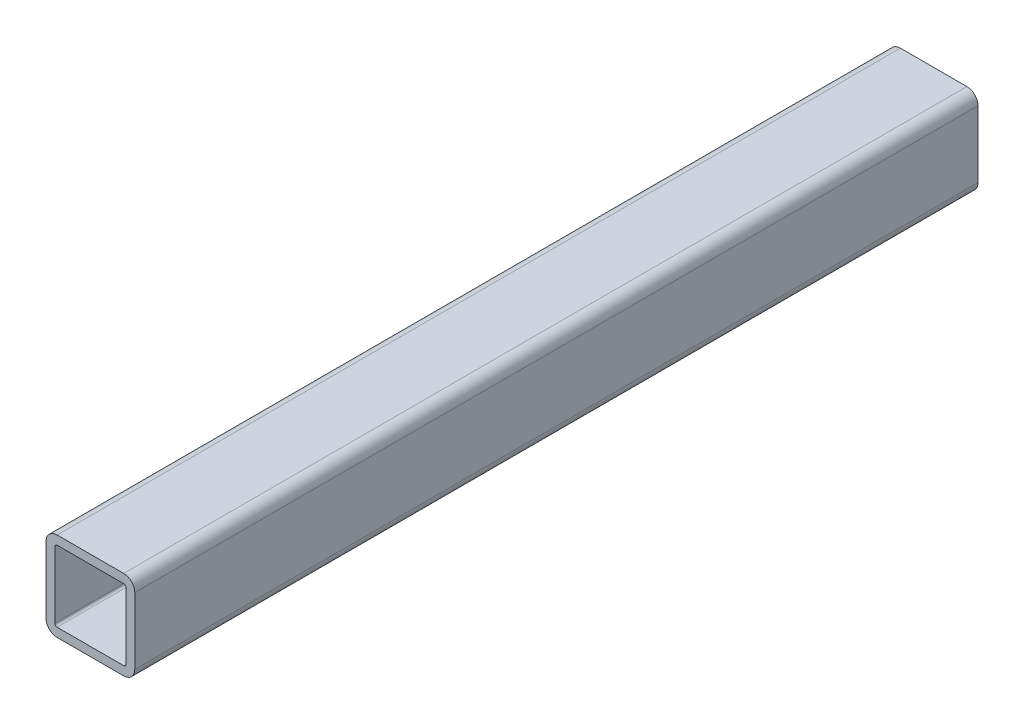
ISO-10303-21;
HEADER;
FILE_DESCRIPTION(('STEP AP214'),'2;1');
FILE_NAME('part.step','',(''),(''),'','','');
FILE_SCHEMA(('AUTOMOTIVE_DESIGN { 1 0 10303 214 1 1 1 1 }'));
ENDSEC;
DATA;
#1=APPLICATION_CONTEXT('core data for automotive mechanical design processes');
#2=APPLICATION_PROTOCOL_DEFINITION('international standard','automotive_design',2000,#1);
#3=PRODUCT_CONTEXT('',#1,'mechanical');
#4=PRODUCT('Part','Part','',(#3));
#5=PRODUCT_RELATED_PRODUCT_CATEGORY('part','',(#4));
#6=PRODUCT_DEFINITION_FORMATION('','',#4);
#7=PRODUCT_DEFINITION_CONTEXT('part definition',#1,'design');
#8=PRODUCT_DEFINITION('design','',#6,#7);
#9=PRODUCT_DEFINITION_SHAPE('','',#8);
#10=(LENGTH_UNIT() NAMED_UNIT(*) SI_UNIT(.MILLI.,.METRE.));
#11=(NAMED_UNIT(*) PLANE_ANGLE_UNIT() SI_UNIT($,.RADIAN.));
#12=(NAMED_UNIT(*) SI_UNIT($,.STERADIAN.) SOLID_ANGLE_UNIT());
#13=UNCERTAINTY_MEASURE_WITH_UNIT(LENGTH_MEASURE(1.E-05),#10,'distance_accuracy_value','');
#14=(GEOMETRIC_REPRESENTATION_CONTEXT(3) GLOBAL_UNCERTAINTY_ASSIGNED_CONTEXT((#13)) GLOBAL_UNIT_ASSIGNED_CONTEXT((#10,
#11,#12)) REPRESENTATION_CONTEXT('',''));
#15=CARTESIAN_POINT('',(0.,0.,0.));
#16=DIRECTION('',(0.,0.,1.));
#17=DIRECTION('',(1.,0.,0.));
#18=AXIS2_PLACEMENT_3D('',#15,#16,#17);
#19=CARTESIAN_POINT('',(-7.5,-7.5,95.));
#20=DIRECTION('',(0.,0.,1.));
#21=DIRECTION('',(1.,0.,0.));
#22=AXIS2_PLACEMENT_3D('',#19,#20,#21);
#23=PLANE('',#22);
#24=CARTESIAN_POINT('',(-7.5,-7.5,95.));
#25=DIRECTION('',(0.,0.,1.));
#26=DIRECTION('',(1.,0.,0.));
#27=AXIS2_PLACEMENT_3D('',#24,#25,#26);
#28=CIRCLE('',#27,2.5);
#29=CARTESIAN_POINT('',(-10.,-7.5,95.));
#30=VERTEX_POINT('',#29);
#31=CARTESIAN_POINT('',(-7.5,-10.,95.));
#32=VERTEX_POINT('',#31);
#33=EDGE_CURVE('E210',#30,#32,#28,.T.);
#34=ORIENTED_EDGE('',*,*,#33,.T.);
#35=DIRECTION('',(1.,0.,0.));
#36=VECTOR('',#35,1.);
#37=CARTESIAN_POINT('',(-7.5,-10.,95.));
#38=LINE('',#37,#36);
#39=CARTESIAN_POINT('',(7.5,-10.,95.));
#40=VERTEX_POINT('',#39);
#41=EDGE_CURVE('E213',#32,#40,#38,.T.);
#42=ORIENTED_EDGE('',*,*,#41,.T.);
#43=CARTESIAN_POINT('',(7.5,-7.5,95.));
#44=DIRECTION('',(0.,0.,1.));
#45=DIRECTION('',(1.,0.,0.));
#46=AXIS2_PLACEMENT_3D('',#43,#44,#45);
#47=CIRCLE('',#46,2.5);
#48=CARTESIAN_POINT('',(10.,-7.5,95.));
#49=VERTEX_POINT('',#48);
#50=EDGE_CURVE('E216',#40,#49,#47,.T.);
#51=ORIENTED_EDGE('',*,*,#50,.T.);
#52=DIRECTION('',(0.,1.,0.));
#53=VECTOR('',#52,1.);
#54=CARTESIAN_POINT('',(10.,7.5,95.));
#55=LINE('',#54,#53);
#56=CARTESIAN_POINT('',(10.,7.5,95.));
#57=VERTEX_POINT('',#56);
#58=EDGE_CURVE('E218',#49,#57,#55,.T.);
#59=ORIENTED_EDGE('',*,*,#58,.T.);
#60=CARTESIAN_POINT('',(7.5,7.5,95.));
#61=DIRECTION('',(0.,0.,1.));
#62=DIRECTION('',(-1.,0.,0.));
#63=AXIS2_PLACEMENT_3D('',#60,#61,#62);
#64=CIRCLE('',#63,2.5);
#65=CARTESIAN_POINT('',(7.5,10.,95.));
#66=VERTEX_POINT('',#65);
#67=EDGE_CURVE('E220',#57,#66,#64,.T.);
#68=ORIENTED_EDGE('',*,*,#67,.T.);
#69=DIRECTION('',(-1.,0.,0.));
#70=VECTOR('',#69,1.);
#71=CARTESIAN_POINT('',(-7.5,10.,95.));
#72=LINE('',#71,#70);
#73=CARTESIAN_POINT('',(-7.5,10.,95.));
#74=VERTEX_POINT('',#73);
#75=EDGE_CURVE('E222',#66,#74,#72,.T.);
#76=ORIENTED_EDGE('',*,*,#75,.T.);
#77=CARTESIAN_POINT('',(-7.5,7.5,95.));
#78=DIRECTION('',(0.,0.,1.));
#79=DIRECTION('',(1.,0.,0.));
#80=AXIS2_PLACEMENT_3D('',#77,#78,#79);
#81=CIRCLE('',#80,2.5);
#82=CARTESIAN_POINT('',(-10.,7.5,95.));
#83=VERTEX_POINT('',#82);
#84=EDGE_CURVE('E224',#74,#83,#81,.T.);
#85=ORIENTED_EDGE('',*,*,#84,.T.);
#86=DIRECTION('',(0.,-1.,0.));
#87=VECTOR('',#86,1.);
#88=CARTESIAN_POINT('',(-10.,7.5,95.));
#89=LINE('',#88,#87);
#90=EDGE_CURVE('E226',#83,#30,#89,.T.);
#91=ORIENTED_EDGE('',*,*,#90,.T.);
#92=EDGE_LOOP('',(#34,#42,#51,#59,#68,#76,#85,#91));
#93=FACE_BOUND('',#92,.T.);
#94=DIRECTION('',(0.,-1.,0.));
#95=VECTOR('',#94,1.);
#96=CARTESIAN_POINT('',(-8.,7.5,95.));
#97=LINE('',#96,#95);
#98=CARTESIAN_POINT('',(-8.,7.5,95.));
#99=VERTEX_POINT('',#98);
#100=CARTESIAN_POINT('',(-8.,-7.5,95.));
#101=VERTEX_POINT('',#100);
#102=EDGE_CURVE('E153',#99,#101,#97,.T.);
#103=ORIENTED_EDGE('',*,*,#102,.F.);
#104=CARTESIAN_POINT('',(-7.5,7.5,95.));
#105=DIRECTION('',(0.,0.,1.));
#106=DIRECTION('',(1.,0.,0.));
#107=AXIS2_PLACEMENT_3D('',#104,#105,#106);
#108=CIRCLE('',#107,0.5);
#109=CARTESIAN_POINT('',(-7.5,8.,95.));
#110=VERTEX_POINT('',#109);
#111=EDGE_CURVE('E145',#110,#99,#108,.T.);
#112=ORIENTED_EDGE('',*,*,#111,.F.);
#113=DIRECTION('',(-1.,0.,0.));
#114=VECTOR('',#113,1.);
#115=CARTESIAN_POINT('',(-7.5,8.,95.));
#116=LINE('',#115,#114);
#117=CARTESIAN_POINT('',(7.5,8.,95.));
#118=VERTEX_POINT('',#117);
#119=EDGE_CURVE('E178',#118,#110,#116,.T.);
#120=ORIENTED_EDGE('',*,*,#119,.F.);
#121=CARTESIAN_POINT('',(7.5,7.5,95.));
#122=DIRECTION('',(0.,0.,1.));
#123=DIRECTION('',(-1.,0.,0.));
#124=AXIS2_PLACEMENT_3D('',#121,#122,#123);
#125=CIRCLE('',#124,0.5);
#126=CARTESIAN_POINT('',(8.,7.5,95.));
#127=VERTEX_POINT('',#126);
#128=EDGE_CURVE('E176',#127,#118,#125,.T.);
#129=ORIENTED_EDGE('',*,*,#128,.F.);
#130=DIRECTION('',(0.,1.,0.));
#131=VECTOR('',#130,1.);
#132=CARTESIAN_POINT('',(8.,7.5,95.));
#133=LINE('',#132,#131);
#134=CARTESIAN_POINT('',(8.,-7.5,95.));
#135=VERTEX_POINT('',#134);
#136=EDGE_CURVE('E174',#135,#127,#133,.T.);
#137=ORIENTED_EDGE('',*,*,#136,.F.);
#138=CARTESIAN_POINT('',(7.5,-7.5,95.));
#139=DIRECTION('',(0.,0.,1.));
#140=DIRECTION('',(1.,0.,0.));
#141=AXIS2_PLACEMENT_3D('',#138,#139,#140);
#142=CIRCLE('',#141,0.500000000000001);
#143=CARTESIAN_POINT('',(7.5,-8.,95.));
#144=VERTEX_POINT('',#143);
#145=EDGE_CURVE('E172',#144,#135,#142,.T.);
#146=ORIENTED_EDGE('',*,*,#145,.F.);
#147=DIRECTION('',(1.,0.,0.));
#148=VECTOR('',#147,1.);
#149=CARTESIAN_POINT('',(-7.5,-8.,95.));
#150=LINE('',#149,#148);
#151=CARTESIAN_POINT('',(-7.5,-8.,95.));
#152=VERTEX_POINT('',#151);
#153=EDGE_CURVE('E168',#152,#144,#150,.T.);
#154=ORIENTED_EDGE('',*,*,#153,.F.);
#155=CARTESIAN_POINT('',(-7.5,-7.5,95.));
#156=DIRECTION('',(0.,0.,1.));
#157=DIRECTION('',(1.,0.,0.));
#158=AXIS2_PLACEMENT_3D('',#155,#156,#157);
#159=CIRCLE('',#158,0.5);
#160=EDGE_CURVE('E166',#101,#152,#159,.T.);
#161=ORIENTED_EDGE('',*,*,#160,.F.);
#162=EDGE_LOOP('',(#103,#112,#120,#129,#137,#146,#154,#161));
#163=FACE_BOUND('',#162,.T.);
#164=ADVANCED_FACE('F32',(#93,#163),#23,.T.);
#165=CARTESIAN_POINT('',(-7.5,-7.5,-95.));
#166=DIRECTION('',(0.,0.,1.));
#167=DIRECTION('',(1.,0.,0.));
#168=AXIS2_PLACEMENT_3D('',#165,#166,#167);
#169=PLANE('',#168);
#170=CARTESIAN_POINT('',(-7.5,-7.5,-95.));
#171=DIRECTION('',(0.,0.,1.));
#172=DIRECTION('',(1.,0.,0.));
#173=AXIS2_PLACEMENT_3D('',#170,#171,#172);
#174=CIRCLE('',#173,2.5);
#175=CARTESIAN_POINT('',(-10.,-7.5,-95.));
#176=VERTEX_POINT('',#175);
#177=CARTESIAN_POINT('',(-7.5,-10.,-95.));
#178=VERTEX_POINT('',#177);
#179=EDGE_CURVE('E161',#176,#178,#174,.T.);
#180=ORIENTED_EDGE('',*,*,#179,.F.);
#181=DIRECTION('',(0.,-1.,0.));
#182=VECTOR('',#181,1.);
#183=CARTESIAN_POINT('',(-10.,7.5,-95.));
#184=LINE('',#183,#182);
#185=CARTESIAN_POINT('',(-10.,7.5,-95.));
#186=VERTEX_POINT('',#185);
#187=EDGE_CURVE('E214',#186,#176,#184,.T.);
#188=ORIENTED_EDGE('',*,*,#187,.F.);
#189=CARTESIAN_POINT('',(-7.5,7.5,-95.));
#190=DIRECTION('',(0.,0.,1.));
#191=DIRECTION('',(1.,0.,0.));
#192=AXIS2_PLACEMENT_3D('',#189,#190,#191);
#193=CIRCLE('',#192,2.5);
#194=CARTESIAN_POINT('',(-7.5,10.,-95.));
#195=VERTEX_POINT('',#194);
#196=EDGE_CURVE('E241',#195,#186,#193,.T.);
#197=ORIENTED_EDGE('',*,*,#196,.F.);
#198=DIRECTION('',(-1.,0.,0.));
#199=VECTOR('',#198,1.);
#200=CARTESIAN_POINT('',(-7.5,10.,-95.));
#201=LINE('',#200,#199);
#202=CARTESIAN_POINT('',(7.5,10.,-95.));
#203=VERTEX_POINT('',#202);
#204=EDGE_CURVE('E239',#203,#195,#201,.T.);
#205=ORIENTED_EDGE('',*,*,#204,.F.);
#206=CARTESIAN_POINT('',(7.5,7.5,-95.));
#207=DIRECTION('',(0.,0.,1.));
#208=DIRECTION('',(-1.,0.,0.));
#209=AXIS2_PLACEMENT_3D('',#206,#207,#208);
#210=CIRCLE('',#209,2.5);
#211=CARTESIAN_POINT('',(10.,7.5,-95.));
#212=VERTEX_POINT('',#211);
#213=EDGE_CURVE('E237',#212,#203,#210,.T.);
#214=ORIENTED_EDGE('',*,*,#213,.F.);
#215=DIRECTION('',(0.,1.,0.));
#216=VECTOR('',#215,1.);
#217=CARTESIAN_POINT('',(10.,7.5,-95.));
#218=LINE('',#217,#216);
#219=CARTESIAN_POINT('',(10.,-7.5,-95.));
#220=VERTEX_POINT('',#219);
#221=EDGE_CURVE('E235',#220,#212,#218,.T.);
#222=ORIENTED_EDGE('',*,*,#221,.F.);
#223=CARTESIAN_POINT('',(7.5,-7.5,-95.));
#224=DIRECTION('',(0.,0.,1.));
#225=DIRECTION('',(1.,0.,0.));
#226=AXIS2_PLACEMENT_3D('',#223,#224,#225);
#227=CIRCLE('',#226,2.5);
#228=CARTESIAN_POINT('',(7.5,-10.,-95.));
#229=VERTEX_POINT('',#228);
#230=EDGE_CURVE('E233',#229,#220,#227,.T.);
#231=ORIENTED_EDGE('',*,*,#230,.F.);
#232=DIRECTION('',(1.,0.,0.));
#233=VECTOR('',#232,1.);
#234=CARTESIAN_POINT('',(-7.5,-10.,-95.));
#235=LINE('',#234,#233);
#236=EDGE_CURVE('E231',#178,#229,#235,.T.);
#237=ORIENTED_EDGE('',*,*,#236,.F.);
#238=EDGE_LOOP('',(#180,#188,#197,#205,#214,#222,#231,#237));
#239=FACE_BOUND('',#238,.T.);
#240=CARTESIAN_POINT('',(-7.5,7.5,-95.));
#241=DIRECTION('',(0.,0.,1.));
#242=DIRECTION('',(1.,0.,0.));
#243=AXIS2_PLACEMENT_3D('',#240,#241,#242);
#244=CIRCLE('',#243,0.5);
#245=CARTESIAN_POINT('',(-7.5,8.,-95.));
#246=VERTEX_POINT('',#245);
#247=CARTESIAN_POINT('',(-8.,7.5,-95.));
#248=VERTEX_POINT('',#247);
#249=EDGE_CURVE('E55',#246,#248,#244,.T.);
#250=ORIENTED_EDGE('',*,*,#249,.T.);
#251=DIRECTION('',(0.,-1.,0.));
#252=VECTOR('',#251,1.);
#253=CARTESIAN_POINT('',(-8.,7.5,-95.));
#254=LINE('',#253,#252);
#255=CARTESIAN_POINT('',(-8.,-7.5,-95.));
#256=VERTEX_POINT('',#255);
#257=EDGE_CURVE('E160',#248,#256,#254,.T.);
#258=ORIENTED_EDGE('',*,*,#257,.T.);
#259=CARTESIAN_POINT('',(-7.5,-7.5,-95.));
#260=DIRECTION('',(0.,0.,1.));
#261=DIRECTION('',(1.,0.,0.));
#262=AXIS2_PLACEMENT_3D('',#259,#260,#261);
#263=CIRCLE('',#262,0.5);
#264=CARTESIAN_POINT('',(-7.5,-8.,-95.));
#265=VERTEX_POINT('',#264);
#266=EDGE_CURVE('E182',#256,#265,#263,.T.);
#267=ORIENTED_EDGE('',*,*,#266,.T.);
#268=DIRECTION('',(1.,0.,0.));
#269=VECTOR('',#268,1.);
#270=CARTESIAN_POINT('',(-7.5,-8.,-95.));
#271=LINE('',#270,#269);
#272=CARTESIAN_POINT('',(7.5,-8.,-95.));
#273=VERTEX_POINT('',#272);
#274=EDGE_CURVE('E185',#265,#273,#271,.T.);
#275=ORIENTED_EDGE('',*,*,#274,.T.);
#276=CARTESIAN_POINT('',(7.5,-7.5,-95.));
#277=DIRECTION('',(0.,0.,1.));
#278=DIRECTION('',(1.,0.,0.));
#279=AXIS2_PLACEMENT_3D('',#276,#277,#278);
#280=CIRCLE('',#279,0.500000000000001);
#281=CARTESIAN_POINT('',(8.,-7.5,-95.));
#282=VERTEX_POINT('',#281);
#283=EDGE_CURVE('E188',#273,#282,#280,.T.);
#284=ORIENTED_EDGE('',*,*,#283,.T.);
#285=DIRECTION('',(0.,1.,0.));
#286=VECTOR('',#285,1.);
#287=CARTESIAN_POINT('',(8.,7.5,-95.));
#288=LINE('',#287,#286);
#289=CARTESIAN_POINT('',(8.,7.5,-95.));
#290=VERTEX_POINT('',#289);
#291=EDGE_CURVE('E191',#282,#290,#288,.T.);
#292=ORIENTED_EDGE('',*,*,#291,.T.);
#293=CARTESIAN_POINT('',(7.5,7.5,-95.));
#294=DIRECTION('',(0.,0.,1.));
#295=DIRECTION('',(-1.,0.,0.));
#296=AXIS2_PLACEMENT_3D('',#293,#294,#295);
#297=CIRCLE('',#296,0.5);
#298=CARTESIAN_POINT('',(7.5,8.,-95.));
#299=VERTEX_POINT('',#298);
#300=EDGE_CURVE('E194',#290,#299,#297,.T.);
#301=ORIENTED_EDGE('',*,*,#300,.T.);
#302=DIRECTION('',(-1.,0.,0.));
#303=VECTOR('',#302,1.);
#304=CARTESIAN_POINT('',(-7.5,8.,-95.));
#305=LINE('',#304,#303);
#306=EDGE_CURVE('E154',#299,#246,#305,.T.);
#307=ORIENTED_EDGE('',*,*,#306,.T.);
#308=EDGE_LOOP('',(#250,#258,#267,#275,#284,#292,#301,#307));
#309=FACE_BOUND('',#308,.T.);
#310=ADVANCED_FACE('F271',(#239,#309),#169,.F.);
#311=CARTESIAN_POINT('',(-7.5,-7.5,95.));
#312=DIRECTION('',(0.,0.,-1.));
#313=DIRECTION('',(-1.,0.,0.));
#314=AXIS2_PLACEMENT_3D('',#311,#312,#313);
#315=CYLINDRICAL_SURFACE('',#314,2.5);
#316=ORIENTED_EDGE('',*,*,#179,.T.);
#317=DIRECTION('',(0.,0.,-1.));
#318=VECTOR('',#317,1.);
#319=CARTESIAN_POINT('',(-7.5,-10.,95.));
#320=LINE('',#319,#318);
#321=EDGE_CURVE('E11',#32,#178,#320,.T.);
#322=ORIENTED_EDGE('',*,*,#321,.F.);
#323=ORIENTED_EDGE('',*,*,#33,.F.);
#324=DIRECTION('',(0.,0.,-1.));
#325=VECTOR('',#324,1.);
#326=CARTESIAN_POINT('',(-10.,-7.5,95.));
#327=LINE('',#326,#325);
#328=EDGE_CURVE('E228',#30,#176,#327,.T.);
#329=ORIENTED_EDGE('',*,*,#328,.T.);
#330=EDGE_LOOP('',(#316,#322,#323,#329));
#331=FACE_BOUND('',#330,.T.);
#332=ADVANCED_FACE('F34',(#331),#315,.T.);
#333=CARTESIAN_POINT('',(-7.5,-10.,95.));
#334=DIRECTION('',(0.,1.,0.));
#335=DIRECTION('',(0.,0.,1.));
#336=AXIS2_PLACEMENT_3D('',#333,#334,#335);
#337=PLANE('',#336);
#338=ORIENTED_EDGE('',*,*,#236,.T.);
#339=DIRECTION('',(0.,0.,-1.));
#340=VECTOR('',#339,1.);
#341=CARTESIAN_POINT('',(7.5,-10.,95.));
#342=LINE('',#341,#340);
#343=EDGE_CURVE('E40',#40,#229,#342,.T.);
#344=ORIENTED_EDGE('',*,*,#343,.F.);
#345=ORIENTED_EDGE('',*,*,#41,.F.);
#346=ORIENTED_EDGE('',*,*,#321,.T.);
#347=EDGE_LOOP('',(#338,#344,#345,#346));
#348=FACE_BOUND('',#347,.T.);
#349=ADVANCED_FACE('F288',(#348),#337,.F.);
#350=CARTESIAN_POINT('',(7.5,-7.5,95.));
#351=DIRECTION('',(0.,0.,-1.));
#352=DIRECTION('',(-1.,0.,0.));
#353=AXIS2_PLACEMENT_3D('',#350,#351,#352);
#354=CYLINDRICAL_SURFACE('',#353,2.5);
#355=ORIENTED_EDGE('',*,*,#230,.T.);
#356=DIRECTION('',(0.,0.,-1.));
#357=VECTOR('',#356,1.);
#358=CARTESIAN_POINT('',(10.,-7.5,95.));
#359=LINE('',#358,#357);
#360=EDGE_CURVE('E258',#49,#220,#359,.T.);
#361=ORIENTED_EDGE('',*,*,#360,.F.);
#362=ORIENTED_EDGE('',*,*,#50,.F.);
#363=ORIENTED_EDGE('',*,*,#343,.T.);
#364=EDGE_LOOP('',(#355,#361,#362,#363));
#365=FACE_BOUND('',#364,.T.);
#366=ADVANCED_FACE('F265',(#365),#354,.T.);
#367=CARTESIAN_POINT('',(10.,7.5,95.));
#368=DIRECTION('',(-1.,0.,0.));
#369=DIRECTION('',(0.,-1.,0.));
#370=AXIS2_PLACEMENT_3D('',#367,#368,#369);
#371=PLANE('',#370);
#372=ORIENTED_EDGE('',*,*,#221,.T.);
#373=DIRECTION('',(0.,0.,-1.));
#374=VECTOR('',#373,1.);
#375=CARTESIAN_POINT('',(10.,7.5,95.));
#376=LINE('',#375,#374);
#377=EDGE_CURVE('E255',#57,#212,#376,.T.);
#378=ORIENTED_EDGE('',*,*,#377,.F.);
#379=ORIENTED_EDGE('',*,*,#58,.F.);
#380=ORIENTED_EDGE('',*,*,#360,.T.);
#381=EDGE_LOOP('',(#372,#378,#379,#380));
#382=FACE_BOUND('',#381,.T.);
#383=ADVANCED_FACE('F277',(#382),#371,.F.);
#384=CARTESIAN_POINT('',(7.5,7.5,95.));
#385=DIRECTION('',(0.,0.,-1.));
#386=DIRECTION('',(-1.,0.,0.));
#387=AXIS2_PLACEMENT_3D('',#384,#385,#386);
#388=CYLINDRICAL_SURFACE('',#387,2.5);
#389=ORIENTED_EDGE('',*,*,#213,.T.);
#390=DIRECTION('',(0.,0.,-1.));
#391=VECTOR('',#390,1.);
#392=CARTESIAN_POINT('',(7.5,10.,95.));
#393=LINE('',#392,#391);
#394=EDGE_CURVE('E252',#66,#203,#393,.T.);
#395=ORIENTED_EDGE('',*,*,#394,.F.);
#396=ORIENTED_EDGE('',*,*,#67,.F.);
#397=ORIENTED_EDGE('',*,*,#377,.T.);
#398=EDGE_LOOP('',(#389,#395,#396,#397));
#399=FACE_BOUND('',#398,.T.);
#400=ADVANCED_FACE('F281',(#399),#388,.T.);
#401=CARTESIAN_POINT('',(-7.5,10.,95.));
#402=DIRECTION('',(0.,-1.,0.));
#403=DIRECTION('',(0.,0.,-1.));
#404=AXIS2_PLACEMENT_3D('',#401,#402,#403);
#405=PLANE('',#404);
#406=ORIENTED_EDGE('',*,*,#204,.T.);
#407=DIRECTION('',(0.,0.,-1.));
#408=VECTOR('',#407,1.);
#409=CARTESIAN_POINT('',(-7.5,10.,95.));
#410=LINE('',#409,#408);
#411=EDGE_CURVE('E249',#74,#195,#410,.T.);
#412=ORIENTED_EDGE('',*,*,#411,.F.);
#413=ORIENTED_EDGE('',*,*,#75,.F.);
#414=ORIENTED_EDGE('',*,*,#394,.T.);
#415=EDGE_LOOP('',(#406,#412,#413,#414));
#416=FACE_BOUND('',#415,.T.);
#417=ADVANCED_FACE('F301',(#416),#405,.F.);
#418=CARTESIAN_POINT('',(-7.5,7.5,95.));
#419=DIRECTION('',(0.,0.,-1.));
#420=DIRECTION('',(-1.,0.,0.));
#421=AXIS2_PLACEMENT_3D('',#418,#419,#420);
#422=CYLINDRICAL_SURFACE('',#421,2.5);
#423=ORIENTED_EDGE('',*,*,#196,.T.);
#424=DIRECTION('',(0.,0.,-1.));
#425=VECTOR('',#424,1.);
#426=CARTESIAN_POINT('',(-10.,7.5,95.));
#427=LINE('',#426,#425);
#428=EDGE_CURVE('E246',#83,#186,#427,.T.);
#429=ORIENTED_EDGE('',*,*,#428,.F.);
#430=ORIENTED_EDGE('',*,*,#84,.F.);
#431=ORIENTED_EDGE('',*,*,#411,.T.);
#432=EDGE_LOOP('',(#423,#429,#430,#431));
#433=FACE_BOUND('',#432,.T.);
#434=ADVANCED_FACE('F299',(#433),#422,.T.);
#435=CARTESIAN_POINT('',(-10.,7.5,95.));
#436=DIRECTION('',(1.,0.,0.));
#437=DIRECTION('',(0.,0.,-1.));
#438=AXIS2_PLACEMENT_3D('',#435,#436,#437);
#439=PLANE('',#438);
#440=ORIENTED_EDGE('',*,*,#187,.T.);
#441=ORIENTED_EDGE('',*,*,#328,.F.);
#442=ORIENTED_EDGE('',*,*,#90,.F.);
#443=ORIENTED_EDGE('',*,*,#428,.T.);
#444=EDGE_LOOP('',(#440,#441,#442,#443));
#445=FACE_BOUND('',#444,.T.);
#446=ADVANCED_FACE('F294',(#445),#439,.F.);
#447=CARTESIAN_POINT('',(-7.5,7.5,95.));
#448=DIRECTION('',(0.,0.,-1.));
#449=DIRECTION('',(-1.,0.,0.));
#450=AXIS2_PLACEMENT_3D('',#447,#448,#449);
#451=CYLINDRICAL_SURFACE('',#450,0.5);
#452=ORIENTED_EDGE('',*,*,#249,.F.);
#453=DIRECTION('',(0.,0.,-1.));
#454=VECTOR('',#453,1.);
#455=CARTESIAN_POINT('',(-7.5,8.,95.));
#456=LINE('',#455,#454);
#457=EDGE_CURVE('E149',#110,#246,#456,.T.);
#458=ORIENTED_EDGE('',*,*,#457,.F.);
#459=ORIENTED_EDGE('',*,*,#111,.T.);
#460=DIRECTION('',(0.,0.,-1.));
#461=VECTOR('',#460,1.);
#462=CARTESIAN_POINT('',(-8.,7.5,95.));
#463=LINE('',#462,#461);
#464=EDGE_CURVE('E148',#99,#248,#463,.T.);
#465=ORIENTED_EDGE('',*,*,#464,.T.);
#466=EDGE_LOOP('',(#452,#458,#459,#465));
#467=FACE_BOUND('',#466,.T.);
#468=ADVANCED_FACE('F147',(#467),#451,.F.);
#469=CARTESIAN_POINT('',(-8.,7.5,95.));
#470=DIRECTION('',(1.,0.,0.));
#471=DIRECTION('',(0.,1.,0.));
#472=AXIS2_PLACEMENT_3D('',#469,#470,#471);
#473=PLANE('',#472);
#474=ORIENTED_EDGE('',*,*,#257,.F.);
#475=ORIENTED_EDGE('',*,*,#464,.F.);
#476=ORIENTED_EDGE('',*,*,#102,.T.);
#477=DIRECTION('',(0.,0.,-1.));
#478=VECTOR('',#477,1.);
#479=CARTESIAN_POINT('',(-8.,-7.5,95.));
#480=LINE('',#479,#478);
#481=EDGE_CURVE('E162',#101,#256,#480,.T.);
#482=ORIENTED_EDGE('',*,*,#481,.T.);
#483=EDGE_LOOP('',(#474,#475,#476,#482));
#484=FACE_BOUND('',#483,.T.);
#485=ADVANCED_FACE('F157',(#484),#473,.T.);
#486=CARTESIAN_POINT('',(-7.5,-7.5,95.));
#487=DIRECTION('',(0.,0.,-1.));
#488=DIRECTION('',(-1.,0.,0.));
#489=AXIS2_PLACEMENT_3D('',#486,#487,#488);
#490=CYLINDRICAL_SURFACE('',#489,0.5);
#491=ORIENTED_EDGE('',*,*,#266,.F.);
#492=ORIENTED_EDGE('',*,*,#481,.F.);
#493=ORIENTED_EDGE('',*,*,#160,.T.);
#494=DIRECTION('',(0.,0.,-1.));
#495=VECTOR('',#494,1.);
#496=CARTESIAN_POINT('',(-7.5,-8.,95.));
#497=LINE('',#496,#495);
#498=EDGE_CURVE('E207',#152,#265,#497,.T.);
#499=ORIENTED_EDGE('',*,*,#498,.T.);
#500=EDGE_LOOP('',(#491,#492,#493,#499));
#501=FACE_BOUND('',#500,.T.);
#502=ADVANCED_FACE('F326',(#501),#490,.F.);
#503=CARTESIAN_POINT('',(-7.5,-8.,95.));
#504=DIRECTION('',(0.,1.,0.));
#505=DIRECTION('',(0.,0.,1.));
#506=AXIS2_PLACEMENT_3D('',#503,#504,#505);
#507=PLANE('',#506);
#508=ORIENTED_EDGE('',*,*,#274,.F.);
#509=ORIENTED_EDGE('',*,*,#498,.F.);
#510=ORIENTED_EDGE('',*,*,#153,.T.);
#511=DIRECTION('',(0.,0.,-1.));
#512=VECTOR('',#511,1.);
#513=CARTESIAN_POINT('',(7.5,-8.,95.));
#514=LINE('',#513,#512);
#515=EDGE_CURVE('E205',#144,#273,#514,.T.);
#516=ORIENTED_EDGE('',*,*,#515,.T.);
#517=EDGE_LOOP('',(#508,#509,#510,#516));
#518=FACE_BOUND('',#517,.T.);
#519=ADVANCED_FACE('F330',(#518),#507,.T.);
#520=CARTESIAN_POINT('',(7.5,-7.5,95.));
#521=DIRECTION('',(0.,0.,-1.));
#522=DIRECTION('',(-1.,0.,0.));
#523=AXIS2_PLACEMENT_3D('',#520,#521,#522);
#524=CYLINDRICAL_SURFACE('',#523,0.500000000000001);
#525=ORIENTED_EDGE('',*,*,#283,.F.);
#526=ORIENTED_EDGE('',*,*,#515,.F.);
#527=ORIENTED_EDGE('',*,*,#145,.T.);
#528=DIRECTION('',(0.,0.,-1.));
#529=VECTOR('',#528,1.);
#530=CARTESIAN_POINT('',(8.,-7.5,95.));
#531=LINE('',#530,#529);
#532=EDGE_CURVE('E203',#135,#282,#531,.T.);
#533=ORIENTED_EDGE('',*,*,#532,.T.);
#534=EDGE_LOOP('',(#525,#526,#527,#533));
#535=FACE_BOUND('',#534,.T.);
#536=ADVANCED_FACE('F336',(#535),#524,.F.);
#537=CARTESIAN_POINT('',(8.,7.5,95.));
#538=DIRECTION('',(-1.,0.,0.));
#539=DIRECTION('',(0.,-1.,0.));
#540=AXIS2_PLACEMENT_3D('',#537,#538,#539);
#541=PLANE('',#540);
#542=ORIENTED_EDGE('',*,*,#291,.F.);
#543=ORIENTED_EDGE('',*,*,#532,.F.);
#544=ORIENTED_EDGE('',*,*,#136,.T.);
#545=DIRECTION('',(0.,0.,-1.));
#546=VECTOR('',#545,1.);
#547=CARTESIAN_POINT('',(8.,7.5,95.));
#548=LINE('',#547,#546);
#549=EDGE_CURVE('E201',#127,#290,#548,.T.);
#550=ORIENTED_EDGE('',*,*,#549,.T.);
#551=EDGE_LOOP('',(#542,#543,#544,#550));
#552=FACE_BOUND('',#551,.T.);
#553=ADVANCED_FACE('F340',(#552),#541,.T.);
#554=CARTESIAN_POINT('',(7.5,7.5,95.));
#555=DIRECTION('',(0.,0.,-1.));
#556=DIRECTION('',(-1.,0.,0.));
#557=AXIS2_PLACEMENT_3D('',#554,#555,#556);
#558=CYLINDRICAL_SURFACE('',#557,0.5);
#559=ORIENTED_EDGE('',*,*,#300,.F.);
#560=ORIENTED_EDGE('',*,*,#549,.F.);
#561=ORIENTED_EDGE('',*,*,#128,.T.);
#562=DIRECTION('',(0.,0.,-1.));
#563=VECTOR('',#562,1.);
#564=CARTESIAN_POINT('',(7.5,8.,95.));
#565=LINE('',#564,#563);
#566=EDGE_CURVE('E47',#118,#299,#565,.T.);
#567=ORIENTED_EDGE('',*,*,#566,.T.);
#568=EDGE_LOOP('',(#559,#560,#561,#567));
#569=FACE_BOUND('',#568,.T.);
#570=ADVANCED_FACE('F344',(#569),#558,.F.);
#571=CARTESIAN_POINT('',(-7.5,8.,95.));
#572=DIRECTION('',(0.,-1.,0.));
#573=DIRECTION('',(0.,0.,-1.));
#574=AXIS2_PLACEMENT_3D('',#571,#572,#573);
#575=PLANE('',#574);
#576=ORIENTED_EDGE('',*,*,#306,.F.);
#577=ORIENTED_EDGE('',*,*,#566,.F.);
#578=ORIENTED_EDGE('',*,*,#119,.T.);
#579=ORIENTED_EDGE('',*,*,#457,.T.);
#580=EDGE_LOOP('',(#576,#577,#578,#579));
#581=FACE_BOUND('',#580,.T.);
#582=ADVANCED_FACE('F348',(#581),#575,.T.);
#583=CLOSED_SHELL('',(#164,#310,#332,#349,#366,#383,#400,#417,#434,#446,#468,#485,#502,#519,
#536,#553,#570,#582));
#584=MANIFOLD_SOLID_BREP('B2',#583);
#585=ADVANCED_BREP_SHAPE_REPRESENTATION('',(#18,#584),#14);
#586=SHAPE_DEFINITION_REPRESENTATION(#9,#585);
ENDSEC;
END-ISO-10303-21;
